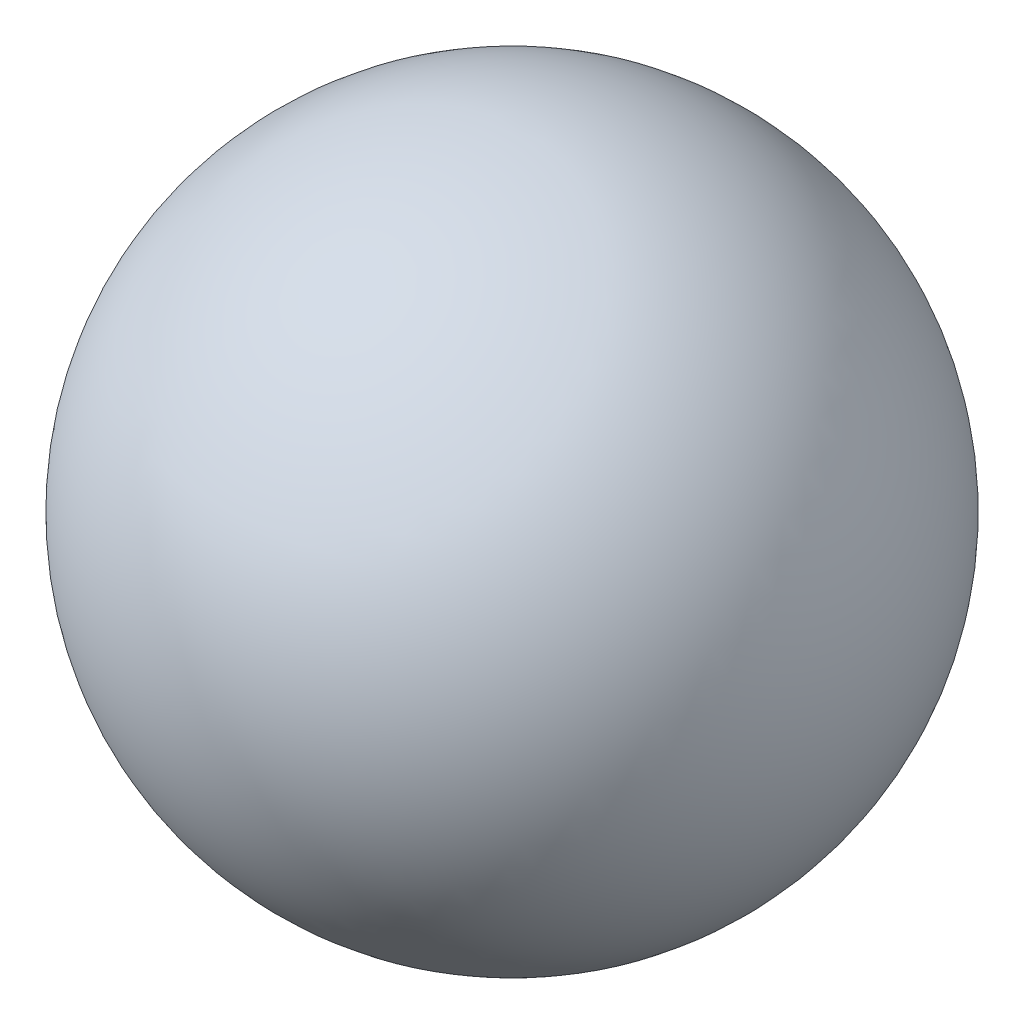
from build123d import *


with BuildPart() as part:
    # Schizzo1 → Rivoluzione1 (revolve)
    with BuildSketch(Plane.XY):
        with BuildLine():
            Line((0, 7.5), (0, -7.5))
            ThreePointArc((0, -7.5), (-7.5, 0), (0, 7.5))
        make_face()
    revolve(axis=Axis((0, 7.5, 0), (0, -1, 0)))


solid = part.part
